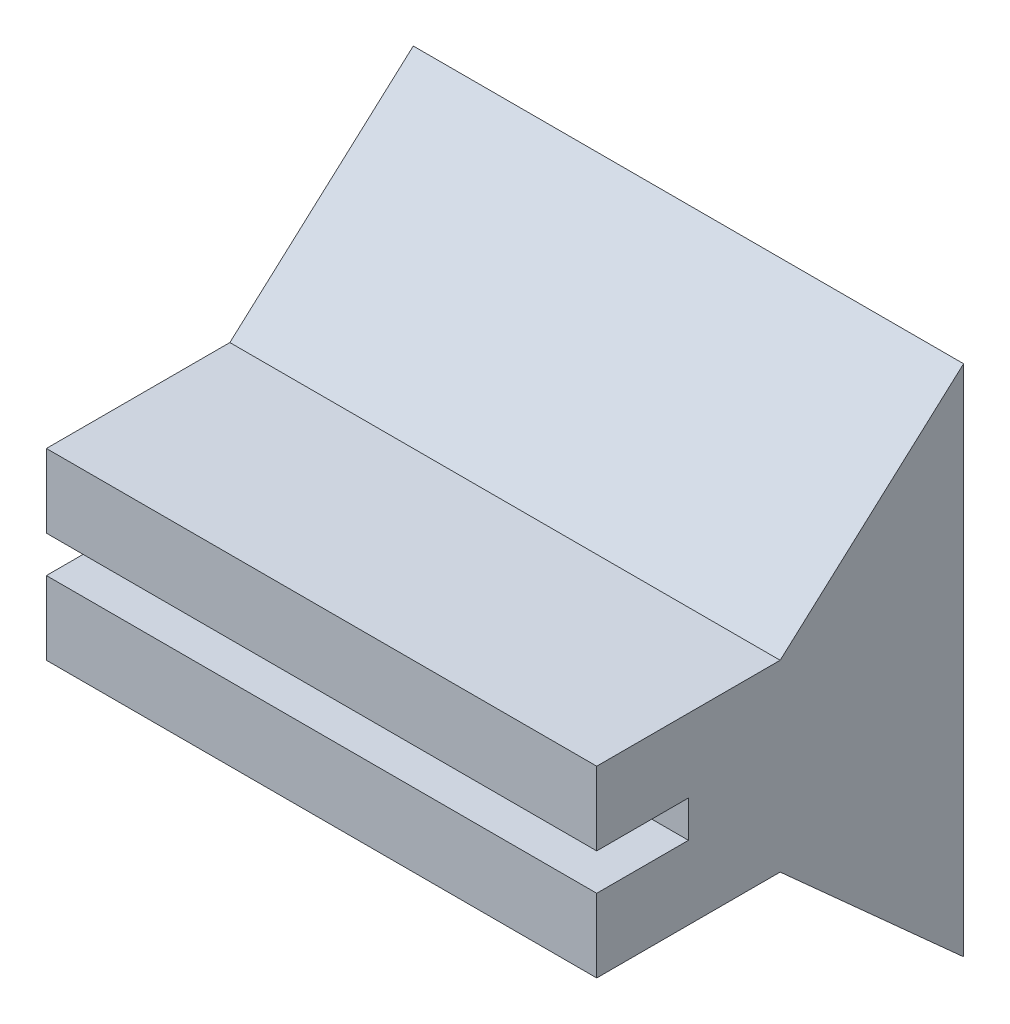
from build123d import *

# Parameters (mm, degrees)
SKETCH1_W           = 30
SKETCH1_H           = 10
BOSS_EXTRUDE1_DEPTH = 20
SKETCH2_W           = 30
SKETCH2_H           = 2
CUT_EXTRUDE1_DEPTH  = 5
BOSS_EXTRUDE2_DEPTH = 30


with BuildPart() as part:
    # Sketch1 → Boss-Extrude1 (new body)
    with BuildSketch(Plane.XY):
        Rectangle(SKETCH1_W, SKETCH1_H)
    extrude(amount=BOSS_EXTRUDE1_DEPTH)

    # Sketch2 → Cut-Extrude1 (cut)
    with BuildSketch(Plane.XY.offset(20)):
        Rectangle(SKETCH2_W, SKETCH2_H)
    extrude(amount=-CUT_EXTRUDE1_DEPTH, mode=Mode.SUBTRACT)

    # Sketch3 → Boss-Extrude2 (add)
    with BuildSketch(Plane.ZY.offset(15)):
        Polygon((0, -5), (0, -14), (10, -5), align=None)
        Polygon((10, 5), (0, 5), (0, 14), align=None)
    extrude(amount=-BOSS_EXTRUDE2_DEPTH)


solid = part.part
